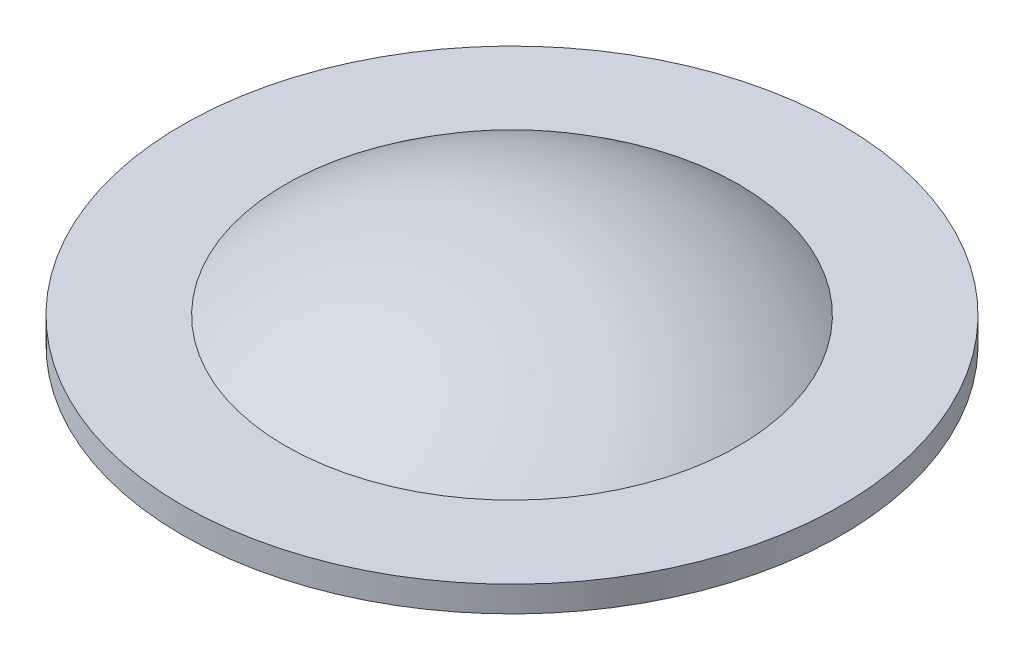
ISO-10303-21;
HEADER;
FILE_DESCRIPTION(('STEP AP214'),'2;1');
FILE_NAME('part.step','',(''),(''),'','','');
FILE_SCHEMA(('AUTOMOTIVE_DESIGN { 1 0 10303 214 1 1 1 1 }'));
ENDSEC;
DATA;
#1=APPLICATION_CONTEXT('core data for automotive mechanical design processes');
#2=APPLICATION_PROTOCOL_DEFINITION('international standard','automotive_design',2000,#1);
#3=PRODUCT_CONTEXT('',#1,'mechanical');
#4=PRODUCT('Part','Part','',(#3));
#5=PRODUCT_RELATED_PRODUCT_CATEGORY('part','',(#4));
#6=PRODUCT_DEFINITION_FORMATION('','',#4);
#7=PRODUCT_DEFINITION_CONTEXT('part definition',#1,'design');
#8=PRODUCT_DEFINITION('design','',#6,#7);
#9=PRODUCT_DEFINITION_SHAPE('','',#8);
#10=(LENGTH_UNIT() NAMED_UNIT(*) SI_UNIT(.MILLI.,.METRE.));
#11=(NAMED_UNIT(*) PLANE_ANGLE_UNIT() SI_UNIT($,.RADIAN.));
#12=(NAMED_UNIT(*) SI_UNIT($,.STERADIAN.) SOLID_ANGLE_UNIT());
#13=UNCERTAINTY_MEASURE_WITH_UNIT(LENGTH_MEASURE(1.E-05),#10,'distance_accuracy_value','');
#14=(GEOMETRIC_REPRESENTATION_CONTEXT(3) GLOBAL_UNCERTAINTY_ASSIGNED_CONTEXT((#13)) GLOBAL_UNIT_ASSIGNED_CONTEXT((#10,
#11,#12)) REPRESENTATION_CONTEXT('',''));
#15=CARTESIAN_POINT('',(0.,0.,0.));
#16=DIRECTION('',(0.,0.,1.));
#17=DIRECTION('',(1.,0.,0.));
#18=AXIS2_PLACEMENT_3D('',#15,#16,#17);
#19=CARTESIAN_POINT('',(0.,4.5,0.));
#20=DIRECTION('',(0.,1.,0.));
#21=DIRECTION('',(0.,0.,1.));
#22=AXIS2_PLACEMENT_3D('',#19,#20,#21);
#23=CYLINDRICAL_SURFACE('',#22,44.);
#24=CARTESIAN_POINT('',(0.,4.5,0.));
#25=DIRECTION('',(0.,1.,0.));
#26=DIRECTION('',(0.,0.,1.));
#27=AXIS2_PLACEMENT_3D('',#24,#25,#26);
#28=CIRCLE('',#27,44.);
#29=CARTESIAN_POINT('',(0.,4.5,44.));
#30=VERTEX_POINT('',#29);
#31=EDGE_CURVE('E11',#30,#30,#28,.T.);
#32=ORIENTED_EDGE('',*,*,#31,.T.);
#33=EDGE_LOOP('',(#32));
#34=FACE_BOUND('',#33,.T.);
#35=CARTESIAN_POINT('',(0.,5.,0.));
#36=DIRECTION('',(0.,1.,0.));
#37=DIRECTION('',(0.,0.,1.));
#38=AXIS2_PLACEMENT_3D('',#35,#36,#37);
#39=CIRCLE('',#38,44.);
#40=CARTESIAN_POINT('',(0.,5.,44.));
#41=VERTEX_POINT('',#40);
#42=EDGE_CURVE('E45',#41,#41,#39,.T.);
#43=ORIENTED_EDGE('',*,*,#42,.F.);
#44=EDGE_LOOP('',(#43));
#45=FACE_BOUND('',#44,.T.);
#46=ADVANCED_FACE('F41',(#34,#45),#23,.T.);
#47=CARTESIAN_POINT('',(0.,4.5,0.));
#48=DIRECTION('',(0.,1.,0.));
#49=DIRECTION('',(0.,0.,1.));
#50=AXIS2_PLACEMENT_3D('',#47,#48,#49);
#51=PLANE('',#50);
#52=ORIENTED_EDGE('',*,*,#31,.F.);
#53=EDGE_LOOP('',(#52));
#54=FACE_BOUND('',#53,.T.);
#55=ADVANCED_FACE('F56',(#54),#51,.F.);
#56=CARTESIAN_POINT('',(0.,-52.0333333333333,0.));
#57=DIRECTION('',(0.,0.,1.));
#58=DIRECTION('',(1.,0.,0.));
#59=AXIS2_PLACEMENT_3D('',#56,#57,#58);
#60=SPHERICAL_SURFACE('',#59,72.0333333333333);
#61=CARTESIAN_POINT('',(0.,-52.0333333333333,0.));
#62=DIRECTION('',(0.,1.,0.));
#63=DIRECTION('',(0.,0.,1.));
#64=AXIS2_PLACEMENT_3D('',#61,#62,#63);
#65=SPHERICAL_SURFACE('',#64,72.0333333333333);
#66=ORIENTED_EDGE('',*,*,#42,.T.);
#67=EDGE_LOOP('',(#66));
#68=FACE_BOUND('',#67,.T.);
#69=ADVANCED_FACE('F43',(#68),#65,.T.);
#70=CLOSED_SHELL('',(#46,#55,#69));
#71=MANIFOLD_SOLID_BREP('B2',#70);
#72=CARTESIAN_POINT('',(0.,5.,0.));
#73=DIRECTION('',(0.,1.,0.));
#74=DIRECTION('',(0.,0.,1.));
#75=AXIS2_PLACEMENT_3D('',#72,#73,#74);
#76=PLANE('',#75);
#77=CARTESIAN_POINT('',(0.,5.,0.));
#78=DIRECTION('',(0.,1.,0.));
#79=DIRECTION('',(0.,0.,1.));
#80=AXIS2_PLACEMENT_3D('',#77,#78,#79);
#81=CIRCLE('',#80,63.9999999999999);
#82=CARTESIAN_POINT('',(0.,5.,63.9999999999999));
#83=VERTEX_POINT('',#82);
#84=EDGE_CURVE('E40',#83,#83,#81,.T.);
#85=ORIENTED_EDGE('',*,*,#84,.T.);
#86=EDGE_LOOP('',(#85));
#87=FACE_BOUND('',#86,.T.);
#88=CARTESIAN_POINT('',(0.,5.,0.));
#89=DIRECTION('',(0.,1.,0.));
#90=DIRECTION('',(0.,0.,1.));
#91=AXIS2_PLACEMENT_3D('',#88,#89,#90);
#92=CIRCLE('',#91,44.);
#93=CARTESIAN_POINT('',(0.,5.,44.));
#94=VERTEX_POINT('',#93);
#95=EDGE_CURVE('E93',#94,#94,#92,.T.);
#96=ORIENTED_EDGE('',*,*,#95,.F.);
#97=EDGE_LOOP('',(#96));
#98=FACE_BOUND('',#97,.T.);
#99=ADVANCED_FACE('F82',(#87,#98),#76,.T.);
#100=CARTESIAN_POINT('',(0.,0.,0.));
#101=DIRECTION('',(0.,1.,0.));
#102=DIRECTION('',(0.,0.,1.));
#103=AXIS2_PLACEMENT_3D('',#100,#101,#102);
#104=PLANE('',#103);
#105=CARTESIAN_POINT('',(0.,0.,0.));
#106=DIRECTION('',(0.,1.,0.));
#107=DIRECTION('',(0.,0.,1.));
#108=AXIS2_PLACEMENT_3D('',#105,#106,#107);
#109=CIRCLE('',#108,63.9999999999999);
#110=CARTESIAN_POINT('',(0.,0.,63.9999999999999));
#111=VERTEX_POINT('',#110);
#112=EDGE_CURVE('E86',#111,#111,#109,.T.);
#113=ORIENTED_EDGE('',*,*,#112,.F.);
#114=EDGE_LOOP('',(#113));
#115=FACE_BOUND('',#114,.T.);
#116=CARTESIAN_POINT('',(0.,0.,0.));
#117=DIRECTION('',(0.,1.,0.));
#118=DIRECTION('',(0.,0.,1.));
#119=AXIS2_PLACEMENT_3D('',#116,#117,#118);
#120=CIRCLE('',#119,44.);
#121=CARTESIAN_POINT('',(0.,0.,44.));
#122=VERTEX_POINT('',#121);
#123=EDGE_CURVE('E95',#122,#122,#120,.T.);
#124=ORIENTED_EDGE('',*,*,#123,.T.);
#125=EDGE_LOOP('',(#124));
#126=FACE_BOUND('',#125,.T.);
#127=ADVANCED_FACE('F105',(#115,#126),#104,.F.);
#128=CARTESIAN_POINT('',(0.,5.,0.));
#129=DIRECTION('',(0.,-1.,0.));
#130=DIRECTION('',(0.,0.,-1.));
#131=AXIS2_PLACEMENT_3D('',#128,#129,#130);
#132=CYLINDRICAL_SURFACE('',#131,63.9999999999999);
#133=ORIENTED_EDGE('',*,*,#84,.F.);
#134=EDGE_LOOP('',(#133));
#135=FACE_BOUND('',#134,.T.);
#136=ORIENTED_EDGE('',*,*,#112,.T.);
#137=EDGE_LOOP('',(#136));
#138=FACE_BOUND('',#137,.T.);
#139=ADVANCED_FACE('F84',(#135,#138),#132,.T.);
#140=CARTESIAN_POINT('',(0.,5.,0.));
#141=DIRECTION('',(0.,-1.,0.));
#142=DIRECTION('',(0.,0.,-1.));
#143=AXIS2_PLACEMENT_3D('',#140,#141,#142);
#144=CYLINDRICAL_SURFACE('',#143,44.);
#145=ORIENTED_EDGE('',*,*,#95,.T.);
#146=EDGE_LOOP('',(#145));
#147=FACE_BOUND('',#146,.T.);
#148=ORIENTED_EDGE('',*,*,#123,.F.);
#149=EDGE_LOOP('',(#148));
#150=FACE_BOUND('',#149,.T.);
#151=ADVANCED_FACE('F101',(#147,#150),#144,.F.);
#152=CLOSED_SHELL('',(#99,#127,#139,#151));
#153=MANIFOLD_SOLID_BREP('B6',#152);
#154=ADVANCED_BREP_SHAPE_REPRESENTATION('',(#18,#71,#153),#14);
#155=SHAPE_DEFINITION_REPRESENTATION(#9,#154);
ENDSEC;
END-ISO-10303-21;
